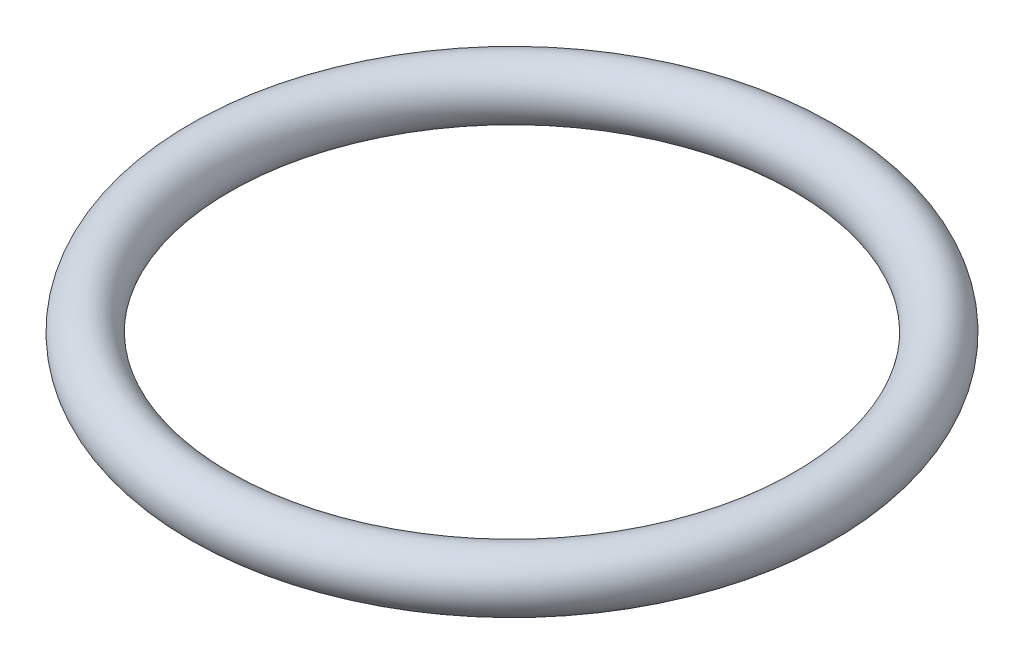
ISO-10303-21;
HEADER;
FILE_DESCRIPTION(('STEP AP214'),'2;1');
FILE_NAME('part.step','',(''),(''),'','','');
FILE_SCHEMA(('AUTOMOTIVE_DESIGN { 1 0 10303 214 1 1 1 1 }'));
ENDSEC;
DATA;
#1=APPLICATION_CONTEXT('core data for automotive mechanical design processes');
#2=APPLICATION_PROTOCOL_DEFINITION('international standard','automotive_design',2000,#1);
#3=PRODUCT_CONTEXT('',#1,'mechanical');
#4=PRODUCT('Part','Part','',(#3));
#5=PRODUCT_RELATED_PRODUCT_CATEGORY('part','',(#4));
#6=PRODUCT_DEFINITION_FORMATION('','',#4);
#7=PRODUCT_DEFINITION_CONTEXT('part definition',#1,'design');
#8=PRODUCT_DEFINITION('design','',#6,#7);
#9=PRODUCT_DEFINITION_SHAPE('','',#8);
#10=(LENGTH_UNIT() NAMED_UNIT(*) SI_UNIT(.MILLI.,.METRE.));
#11=(NAMED_UNIT(*) PLANE_ANGLE_UNIT() SI_UNIT($,.RADIAN.));
#12=(NAMED_UNIT(*) SI_UNIT($,.STERADIAN.) SOLID_ANGLE_UNIT());
#13=UNCERTAINTY_MEASURE_WITH_UNIT(LENGTH_MEASURE(1.E-05),#10,'distance_accuracy_value','');
#14=(GEOMETRIC_REPRESENTATION_CONTEXT(3) GLOBAL_UNCERTAINTY_ASSIGNED_CONTEXT((#13)) GLOBAL_UNIT_ASSIGNED_CONTEXT((#10,
#11,#12)) REPRESENTATION_CONTEXT('',''));
#15=CARTESIAN_POINT('',(0.,0.,0.));
#16=DIRECTION('',(0.,0.,1.));
#17=DIRECTION('',(1.,0.,0.));
#18=AXIS2_PLACEMENT_3D('',#15,#16,#17);
#19=CARTESIAN_POINT('',(0.,0.,0.));
#20=DIRECTION('',(0.,-1.,0.));
#21=DIRECTION('',(0.,0.,-1.));
#22=AXIS2_PLACEMENT_3D('',#19,#20,#21);
#23=TOROIDAL_SURFACE('',#22,19.6,1.8);
#24=CARTESIAN_POINT('',(0.,0.,-21.4));
#25=VERTEX_POINT('',#24);
#26=VERTEX_LOOP('',#25);
#27=FACE_BOUND('',#26,.T.);
#28=ADVANCED_FACE('F27',(#27),#23,.T.);
#29=CLOSED_SHELL('',(#28));
#30=MANIFOLD_SOLID_BREP('B2',#29);
#31=ADVANCED_BREP_SHAPE_REPRESENTATION('',(#18,#30),#14);
#32=SHAPE_DEFINITION_REPRESENTATION(#9,#31);
ENDSEC;
END-ISO-10303-21;
